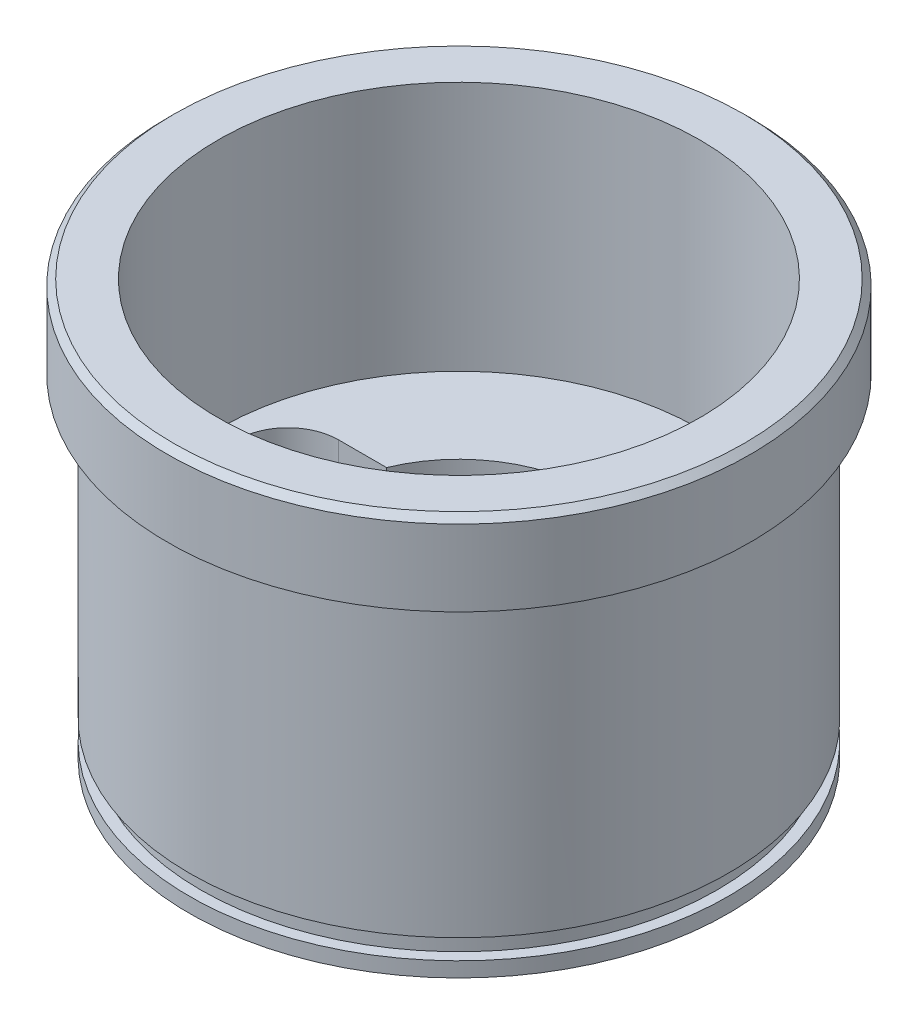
from build123d import *

# Parameters (mm, degrees)
CHANFREIN1_SIZE              = 1
CHANFREIN2_SIZE              = 1
CHANFREIN3_SIZE              = 1.5
CHANFREIN3_SIZE2             = 0.866025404
ESQUISSE4_W                  = 12.671296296
ESQUISSE4_H                  = 3.15
ENL_V_MAT_EXTRU_1_DEPTH      = 7
ENL_V_MAT_EXTRU_2_REACH      = 81.964
ESQUISSE6_R                  = 3.5
R_P_TITION_CIRCULAIRE1_COUNT = 3


with BuildPart() as part:
    # Esquisse2 → R_volution1 (revolve)
    with BuildSketch(Plane.XY, mode=Mode.PRIVATE) as r_volution1_sk:
        Polygon((-42.5, 52.5), (-42.5, 0), (-33, 0), (-33, 14), (-21, 14), (-21, 26), (-38, 26), (-38, 65.5), (-46, 65.5), (-46, 52.5), align=None)
    revolve(r_volution1_sk.sketch.rotate(Axis((0, 0, 0), (0, 1, 0)), 270), axis=Axis((0, 0, 0), (0, 1, 0)))

    # Chanfrein1
    chanfrein1_edges = [part.edges().sort_by_distance(p)[0] for p in [
        (0, 65.5, 46),
    ]]
    chamfer(chanfrein1_edges, length=CHANFREIN1_SIZE)

    # Chanfrein2
    chanfrein2_edges = [part.edges().sort_by_distance(p)[0] for p in [
        (0, 14, 21),
    ]]
    chamfer(chanfrein2_edges, length=CHANFREIN2_SIZE)

    # Chanfrein3
    chanfrein3_edges = [part.edges().sort_by_distance(p)[0] for p in [
        (0, 0, 33),
    ]]
    chanfrein3_side = [part.faces().sort_by_distance(p)[0] for p in [
        (0, 0, 41.297918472),
    ]]
    chamfer(chanfrein3_edges, length=CHANFREIN3_SIZE, length2=CHANFREIN3_SIZE2, reference=chanfrein3_side[0])

    # Esquisse3 → Enl_vement de mati_re-R_volution1 (revolve, cut)
    with BuildSketch(Plane.XY, mode=Mode.PRIVATE) as enl_vement_de_mati_re_r_volution1_sk:
        with BuildLine():
            Line((-34.86, 9.77), (0, 9.77))
            Line((0, 9.77), (0, 5))
            Line((0, 5), (-34.86, 5))
            ThreePointArc((-34.86, 5), (-35.567106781, 5.292893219), (-35.86, 6))
            Line((-35.86, 6), (-35.86, 8.77))
            ThreePointArc((-35.86, 8.77), (-35.567106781, 9.477106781), (-34.86, 9.77))
        make_face()
    revolve(enl_vement_de_mati_re_r_volution1_sk.sketch.rotate(Axis((0, 0, 0), (0, 1, 0)), 270), axis=Axis((0, 0, 0), (0, 1, 0)), mode=Mode.SUBTRACT)

    # Esquisse4 → Enl_vement de mati_re-R_volution2 (revolve, cut)
    with BuildSketch(Plane.XY, mode=Mode.PRIVATE) as enl_vement_de_mati_re_r_volution2_sk:
        with Locations((-47.085648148, 3.925)):
            Rectangle(ESQUISSE4_W, ESQUISSE4_H)
    revolve(enl_vement_de_mati_re_r_volution2_sk.sketch.rotate(Axis((0, 0, 0), (0, -1, 0)), 270), axis=Axis((0, 0, 0), (0, -1, 0)), mode=Mode.SUBTRACT)

    # Esquisse5 → Enl_v. mat.-Extru.1 (cut)
    with BuildSketch(Plane(origin=(0, 26, 0), x_dir=(-1, 0, 0), z_dir=(0, 1, 0))):
        with BuildLine():
            Line((27, -8), (0, -8))
            Line((0, -8), (0, 8))
            Line((0, 8), (27, 8))
            ThreePointArc((27, 8), (35, 0), (27, -8))
        make_face()
    enl_v_mat_extru_1 = extrude(amount=-ENL_V_MAT_EXTRU_1_DEPTH, mode=Mode.SUBTRACT)

    # Esquisse6 → Enl_v. mat.-Extru.2 (cut, up to next)
    with BuildSketch(Plane(origin=(0, 19, 0), x_dir=(-1, 0, 0), z_dir=(0, 1, 0)), mode=Mode.PRIVATE) as enl_v_mat_extru_2_sk1:
        with Locations(Location((27, 0, 0), (0, 0, 90))):
            Circle(ESQUISSE6_R)
    enl_v_mat_extru_2_tool1 = extrude(enl_v_mat_extru_2_sk1.sketch, amount=-ENL_V_MAT_EXTRU_2_REACH, mode=Mode.PRIVATE) & part.part
    enl_v_mat_extru_2 = enl_v_mat_extru_2_tool1.solids().sort_by_distance((-27, 19, 0))[0]
    add(enl_v_mat_extru_2, mode=Mode.SUBTRACT)

    # R_p_tition circulaire1: Enl_v. mat.-Extru.1, Enl_v. mat.-Extru.2 ×3 about axis
    r_p_tition_circulaire1_axis = Axis((0, 0, 0), (0, 1, 0))
    add([enl_v_mat_extru_1.rotate(r_p_tition_circulaire1_axis, i * 360 / R_P_TITION_CIRCULAIRE1_COUNT) for i in range(1, R_P_TITION_CIRCULAIRE1_COUNT)], mode=Mode.SUBTRACT)
    add([enl_v_mat_extru_2.rotate(r_p_tition_circulaire1_axis, i * 360 / R_P_TITION_CIRCULAIRE1_COUNT) for i in range(1, R_P_TITION_CIRCULAIRE1_COUNT)], mode=Mode.SUBTRACT)


solid = part.part
